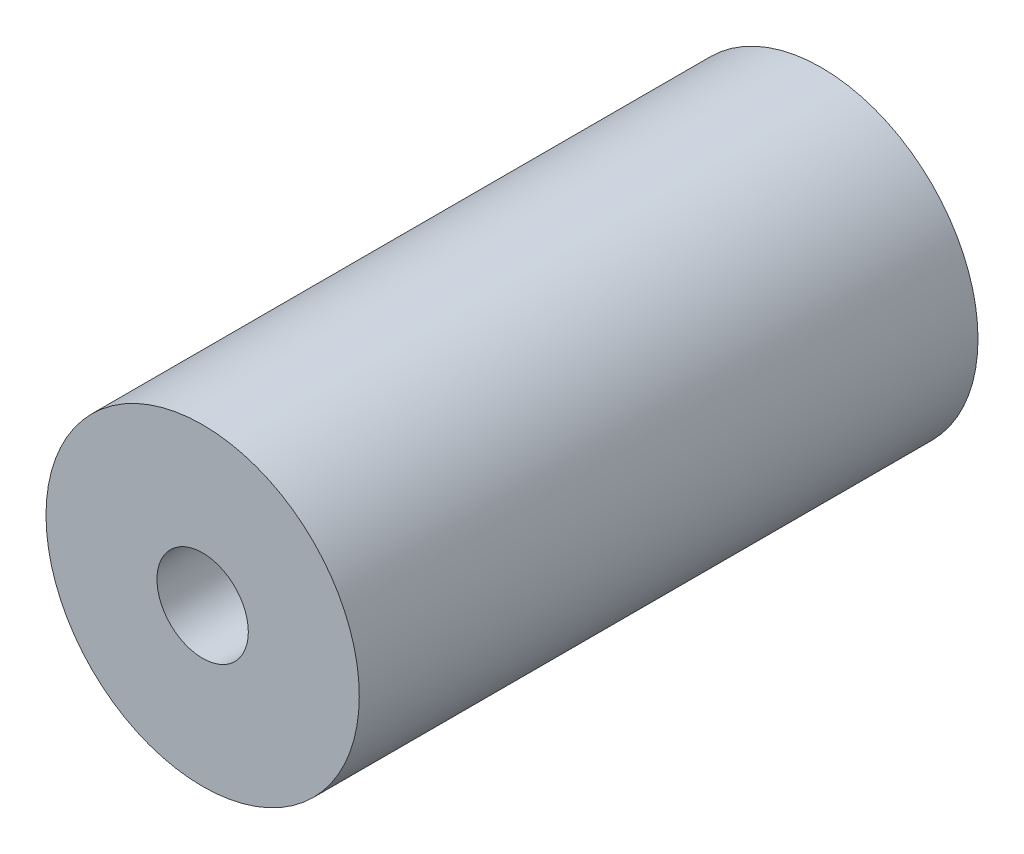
from build123d import *

# Parameters (mm, degrees)
ESQUISSE1_R        = 6
ESQUISSE1_R_2      = 1.75
BOSS_EXTRU_1_DEPTH = 23.7


with BuildPart() as part:
    # Esquisse1 → Boss.-Extru.1 (new body)
    with BuildSketch(Plane.XY):
        Circle(ESQUISSE1_R)
        Circle(ESQUISSE1_R_2, mode=Mode.SUBTRACT)
    extrude(amount=BOSS_EXTRU_1_DEPTH)


solid = part.part
